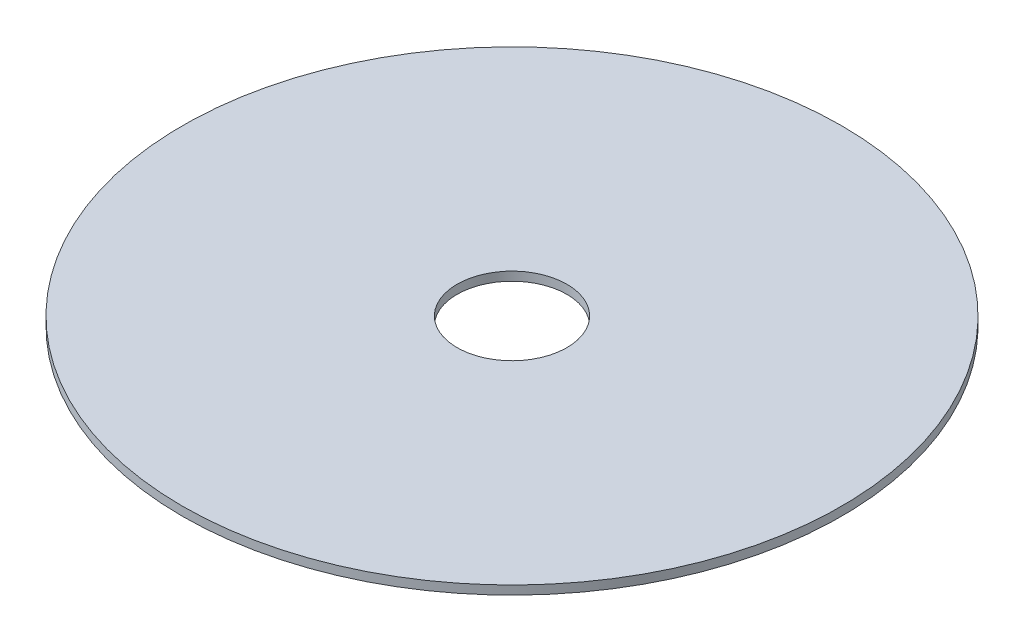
ISO-10303-21;
HEADER;
FILE_DESCRIPTION(('STEP AP214'),'2;1');
FILE_NAME('part.step','',(''),(''),'','','');
FILE_SCHEMA(('AUTOMOTIVE_DESIGN { 1 0 10303 214 1 1 1 1 }'));
ENDSEC;
DATA;
#1=APPLICATION_CONTEXT('core data for automotive mechanical design processes');
#2=APPLICATION_PROTOCOL_DEFINITION('international standard','automotive_design',2000,#1);
#3=PRODUCT_CONTEXT('',#1,'mechanical');
#4=PRODUCT('Part','Part','',(#3));
#5=PRODUCT_RELATED_PRODUCT_CATEGORY('part','',(#4));
#6=PRODUCT_DEFINITION_FORMATION('','',#4);
#7=PRODUCT_DEFINITION_CONTEXT('part definition',#1,'design');
#8=PRODUCT_DEFINITION('design','',#6,#7);
#9=PRODUCT_DEFINITION_SHAPE('','',#8);
#10=(LENGTH_UNIT() NAMED_UNIT(*) SI_UNIT(.MILLI.,.METRE.));
#11=(NAMED_UNIT(*) PLANE_ANGLE_UNIT() SI_UNIT($,.RADIAN.));
#12=(NAMED_UNIT(*) SI_UNIT($,.STERADIAN.) SOLID_ANGLE_UNIT());
#13=UNCERTAINTY_MEASURE_WITH_UNIT(LENGTH_MEASURE(1.E-05),#10,'distance_accuracy_value','');
#14=(GEOMETRIC_REPRESENTATION_CONTEXT(3) GLOBAL_UNCERTAINTY_ASSIGNED_CONTEXT((#13)) GLOBAL_UNIT_ASSIGNED_CONTEXT((#10,
#11,#12)) REPRESENTATION_CONTEXT('',''));
#15=CARTESIAN_POINT('',(0.,0.,0.));
#16=DIRECTION('',(0.,0.,1.));
#17=DIRECTION('',(1.,0.,0.));
#18=AXIS2_PLACEMENT_3D('',#15,#16,#17);
#19=CARTESIAN_POINT('',(0.,0.762,0.));
#20=DIRECTION('',(0.,1.,0.));
#21=DIRECTION('',(0.,0.,1.));
#22=AXIS2_PLACEMENT_3D('',#19,#20,#21);
#23=PLANE('',#22);
#24=CARTESIAN_POINT('',(0.,0.762,0.));
#25=DIRECTION('',(0.,1.,0.));
#26=DIRECTION('',(0.,0.,1.));
#27=AXIS2_PLACEMENT_3D('',#24,#25,#26);
#28=CIRCLE('',#27,28.575);
#29=CARTESIAN_POINT('',(0.,0.762,-28.575));
#30=VERTEX_POINT('',#29);
#31=EDGE_CURVE('E10',#30,#30,#28,.T.);
#32=ORIENTED_EDGE('',*,*,#31,.T.);
#33=EDGE_LOOP('',(#32));
#34=FACE_BOUND('',#33,.T.);
#35=CARTESIAN_POINT('',(0.,0.762,0.));
#36=DIRECTION('',(0.,1.,0.));
#37=DIRECTION('',(0.,0.,1.));
#38=AXIS2_PLACEMENT_3D('',#35,#36,#37);
#39=CIRCLE('',#38,4.7625);
#40=CARTESIAN_POINT('',(0.,0.762,-4.7625));
#41=VERTEX_POINT('',#40);
#42=EDGE_CURVE('E43',#41,#41,#39,.T.);
#43=ORIENTED_EDGE('',*,*,#42,.F.);
#44=EDGE_LOOP('',(#43));
#45=FACE_BOUND('',#44,.T.);
#46=ADVANCED_FACE('F32',(#34,#45),#23,.T.);
#47=CARTESIAN_POINT('',(0.,0.,0.));
#48=DIRECTION('',(0.,1.,0.));
#49=DIRECTION('',(0.,0.,1.));
#50=AXIS2_PLACEMENT_3D('',#47,#48,#49);
#51=PLANE('',#50);
#52=CARTESIAN_POINT('',(0.,0.,0.));
#53=DIRECTION('',(0.,1.,0.));
#54=DIRECTION('',(0.,0.,1.));
#55=AXIS2_PLACEMENT_3D('',#52,#53,#54);
#56=CIRCLE('',#55,28.575);
#57=CARTESIAN_POINT('',(0.,0.,-28.575));
#58=VERTEX_POINT('',#57);
#59=EDGE_CURVE('E36',#58,#58,#56,.T.);
#60=ORIENTED_EDGE('',*,*,#59,.F.);
#61=EDGE_LOOP('',(#60));
#62=FACE_BOUND('',#61,.T.);
#63=CARTESIAN_POINT('',(0.,0.,0.));
#64=DIRECTION('',(0.,1.,0.));
#65=DIRECTION('',(0.,0.,1.));
#66=AXIS2_PLACEMENT_3D('',#63,#64,#65);
#67=CIRCLE('',#66,4.7625);
#68=CARTESIAN_POINT('',(0.,0.,-4.7625));
#69=VERTEX_POINT('',#68);
#70=EDGE_CURVE('E45',#69,#69,#67,.T.);
#71=ORIENTED_EDGE('',*,*,#70,.T.);
#72=EDGE_LOOP('',(#71));
#73=FACE_BOUND('',#72,.T.);
#74=ADVANCED_FACE('F55',(#62,#73),#51,.F.);
#75=CARTESIAN_POINT('',(0.,0.762,0.));
#76=DIRECTION('',(0.,-1.,0.));
#77=DIRECTION('',(0.,0.,-1.));
#78=AXIS2_PLACEMENT_3D('',#75,#76,#77);
#79=CYLINDRICAL_SURFACE('',#78,28.575);
#80=CARTESIAN_POINT('',(0.,0.762,-28.575));
#81=CARTESIAN_POINT('',(0.,0.7540625,-28.575));
#82=CARTESIAN_POINT('',(0.,0.746125,-28.575));
#83=CARTESIAN_POINT('',(0.,0.73025,-28.575));
#84=CARTESIAN_POINT('',(0.,0.7223125,-28.575));
#85=CARTESIAN_POINT('',(0.,0.7064375,-28.575));
#86=CARTESIAN_POINT('',(0.,0.6985,-28.575));
#87=CARTESIAN_POINT('',(0.,0.682625,-28.575));
#88=CARTESIAN_POINT('',(0.,0.6746875,-28.575));
#89=CARTESIAN_POINT('',(0.,0.6588125,-28.575));
#90=CARTESIAN_POINT('',(0.,0.650875,-28.575));
#91=CARTESIAN_POINT('',(0.,0.635,-28.575));
#92=CARTESIAN_POINT('',(0.,0.6270625,-28.575));
#93=CARTESIAN_POINT('',(0.,0.6111875,-28.575));
#94=CARTESIAN_POINT('',(0.,0.60325,-28.575));
#95=CARTESIAN_POINT('',(0.,0.587375,-28.575));
#96=CARTESIAN_POINT('',(0.,0.5794375,-28.575));
#97=CARTESIAN_POINT('',(0.,0.5635625,-28.575));
#98=CARTESIAN_POINT('',(0.,0.555625,-28.575));
#99=CARTESIAN_POINT('',(0.,0.53975,-28.575));
#100=CARTESIAN_POINT('',(0.,0.5318125,-28.575));
#101=CARTESIAN_POINT('',(0.,0.5159375,-28.575));
#102=CARTESIAN_POINT('',(0.,0.508,-28.575));
#103=CARTESIAN_POINT('',(0.,0.492125,-28.575));
#104=CARTESIAN_POINT('',(0.,0.4841875,-28.575));
#105=CARTESIAN_POINT('',(0.,0.4683125,-28.575));
#106=CARTESIAN_POINT('',(0.,0.460375,-28.575));
#107=CARTESIAN_POINT('',(0.,0.4445,-28.575));
#108=CARTESIAN_POINT('',(0.,0.4365625,-28.575));
#109=CARTESIAN_POINT('',(0.,0.4206875,-28.575));
#110=CARTESIAN_POINT('',(0.,0.41275,-28.575));
#111=CARTESIAN_POINT('',(0.,0.396875,-28.575));
#112=CARTESIAN_POINT('',(0.,0.3889375,-28.575));
#113=CARTESIAN_POINT('',(0.,0.3730625,-28.575));
#114=CARTESIAN_POINT('',(0.,0.365125,-28.575));
#115=CARTESIAN_POINT('',(0.,0.34925,-28.575));
#116=CARTESIAN_POINT('',(0.,0.3413125,-28.575));
#117=CARTESIAN_POINT('',(0.,0.3254375,-28.575));
#118=CARTESIAN_POINT('',(0.,0.3175,-28.575));
#119=CARTESIAN_POINT('',(0.,0.301625,-28.575));
#120=CARTESIAN_POINT('',(0.,0.2936875,-28.575));
#121=CARTESIAN_POINT('',(0.,0.2778125,-28.575));
#122=CARTESIAN_POINT('',(0.,0.269875,-28.575));
#123=CARTESIAN_POINT('',(0.,0.254,-28.575));
#124=CARTESIAN_POINT('',(0.,0.2460625,-28.575));
#125=CARTESIAN_POINT('',(0.,0.2301875,-28.575));
#126=CARTESIAN_POINT('',(0.,0.22225,-28.575));
#127=CARTESIAN_POINT('',(0.,0.206375,-28.575));
#128=CARTESIAN_POINT('',(0.,0.1984375,-28.575));
#129=CARTESIAN_POINT('',(0.,0.1825625,-28.575));
#130=CARTESIAN_POINT('',(0.,0.174625,-28.575));
#131=CARTESIAN_POINT('',(0.,0.15875,-28.575));
#132=CARTESIAN_POINT('',(0.,0.1508125,-28.575));
#133=CARTESIAN_POINT('',(0.,0.1349375,-28.575));
#134=CARTESIAN_POINT('',(0.,0.127,-28.575));
#135=CARTESIAN_POINT('',(0.,0.111125,-28.575));
#136=CARTESIAN_POINT('',(0.,0.1031875,-28.575));
#137=CARTESIAN_POINT('',(0.,0.0873125,-28.575));
#138=CARTESIAN_POINT('',(0.,0.079375,-28.575));
#139=CARTESIAN_POINT('',(0.,0.0635,-28.575));
#140=CARTESIAN_POINT('',(0.,0.0555625,-28.575));
#141=CARTESIAN_POINT('',(0.,0.0396875,-28.575));
#142=CARTESIAN_POINT('',(0.,0.03175,-28.575));
#143=CARTESIAN_POINT('',(0.,0.015875,-28.575));
#144=CARTESIAN_POINT('',(0.,0.00793749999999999,-28.575));
#145=CARTESIAN_POINT('',(0.,0.,-28.575));
#146=B_SPLINE_CURVE_WITH_KNOTS('',3,(#80,#81,#82,#83,#84,#85,#86,#87,#88,#89,#90,#91,#92,#93,
#94,#95,#96,#97,#98,#99,#100,#101,#102,#103,#104,#105,#106,#107,#108,#109,#110,#111,#112,#113,
#114,#115,#116,#117,#118,#119,#120,#121,#122,#123,#124,#125,#126,#127,#128,#129,#130,#131,#132,
#133,#134,#135,#136,#137,#138,#139,#140,#141,#142,#143,#144,#145),.UNSPECIFIED.,.F.,.F.,(4,2,2,
2,2,2,2,2,2,2,2,2,2,2,2,2,2,2,2,2,2,2,2,2,2,2,2,2,2,2,2,2,4),(0.,0.0238125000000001,0.047625,
0.0714375,0.0952500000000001,0.1190625,0.142875,0.1666875,0.1905,0.2143125,0.238125,0.2619375,
0.28575,0.3095625,0.333375,0.3571875,0.381,0.4048125,0.428625,0.4524375,0.47625,0.5000625,
0.523875,0.5476875,0.5715,0.5953125,0.619125,0.6429375,0.66675,0.6905625,0.714375,0.7381875,
0.762),.UNSPECIFIED.);
#147=EDGE_CURVE('BSEAM34',#30,#58,#146,.T.);
#148=ORIENTED_EDGE('',*,*,#31,.F.);
#149=ORIENTED_EDGE('',*,*,#59,.T.);
#150=ORIENTED_EDGE('',*,*,#147,.T.);
#151=ORIENTED_EDGE('',*,*,#147,.F.);
#152=EDGE_LOOP('',(#148,#150,#149,#151));
#153=FACE_BOUND('',#152,.T.);
#154=ADVANCED_FACE('F34',(#153),#79,.T.);
#155=CARTESIAN_POINT('',(0.,0.762,0.));
#156=DIRECTION('',(0.,-1.,0.));
#157=DIRECTION('',(0.,0.,-1.));
#158=AXIS2_PLACEMENT_3D('',#155,#156,#157);
#159=CYLINDRICAL_SURFACE('',#158,4.7625);
#160=CARTESIAN_POINT('',(0.,0.762,-4.7625));
#161=CARTESIAN_POINT('',(0.,0.7540625,-4.7625));
#162=CARTESIAN_POINT('',(0.,0.746125,-4.7625));
#163=CARTESIAN_POINT('',(0.,0.73025,-4.7625));
#164=CARTESIAN_POINT('',(0.,0.7223125,-4.7625));
#165=CARTESIAN_POINT('',(0.,0.7064375,-4.7625));
#166=CARTESIAN_POINT('',(0.,0.6985,-4.7625));
#167=CARTESIAN_POINT('',(0.,0.682625,-4.7625));
#168=CARTESIAN_POINT('',(0.,0.6746875,-4.7625));
#169=CARTESIAN_POINT('',(0.,0.6588125,-4.7625));
#170=CARTESIAN_POINT('',(0.,0.650875,-4.7625));
#171=CARTESIAN_POINT('',(0.,0.635,-4.7625));
#172=CARTESIAN_POINT('',(0.,0.6270625,-4.7625));
#173=CARTESIAN_POINT('',(0.,0.6111875,-4.7625));
#174=CARTESIAN_POINT('',(0.,0.60325,-4.7625));
#175=CARTESIAN_POINT('',(0.,0.587375,-4.7625));
#176=CARTESIAN_POINT('',(0.,0.5794375,-4.7625));
#177=CARTESIAN_POINT('',(0.,0.5635625,-4.7625));
#178=CARTESIAN_POINT('',(0.,0.555625,-4.7625));
#179=CARTESIAN_POINT('',(0.,0.53975,-4.7625));
#180=CARTESIAN_POINT('',(0.,0.5318125,-4.7625));
#181=CARTESIAN_POINT('',(0.,0.5159375,-4.7625));
#182=CARTESIAN_POINT('',(0.,0.508,-4.7625));
#183=CARTESIAN_POINT('',(0.,0.492125,-4.7625));
#184=CARTESIAN_POINT('',(0.,0.4841875,-4.7625));
#185=CARTESIAN_POINT('',(0.,0.4683125,-4.7625));
#186=CARTESIAN_POINT('',(0.,0.460375,-4.7625));
#187=CARTESIAN_POINT('',(0.,0.4445,-4.7625));
#188=CARTESIAN_POINT('',(0.,0.4365625,-4.7625));
#189=CARTESIAN_POINT('',(0.,0.4206875,-4.7625));
#190=CARTESIAN_POINT('',(0.,0.41275,-4.7625));
#191=CARTESIAN_POINT('',(0.,0.396875,-4.7625));
#192=CARTESIAN_POINT('',(0.,0.3889375,-4.7625));
#193=CARTESIAN_POINT('',(0.,0.3730625,-4.7625));
#194=CARTESIAN_POINT('',(0.,0.365125,-4.7625));
#195=CARTESIAN_POINT('',(0.,0.34925,-4.7625));
#196=CARTESIAN_POINT('',(0.,0.3413125,-4.7625));
#197=CARTESIAN_POINT('',(0.,0.3254375,-4.7625));
#198=CARTESIAN_POINT('',(0.,0.3175,-4.7625));
#199=CARTESIAN_POINT('',(0.,0.301625,-4.7625));
#200=CARTESIAN_POINT('',(0.,0.2936875,-4.7625));
#201=CARTESIAN_POINT('',(0.,0.2778125,-4.7625));
#202=CARTESIAN_POINT('',(0.,0.269875,-4.7625));
#203=CARTESIAN_POINT('',(0.,0.254,-4.7625));
#204=CARTESIAN_POINT('',(0.,0.2460625,-4.7625));
#205=CARTESIAN_POINT('',(0.,0.2301875,-4.7625));
#206=CARTESIAN_POINT('',(0.,0.22225,-4.7625));
#207=CARTESIAN_POINT('',(0.,0.206375,-4.7625));
#208=CARTESIAN_POINT('',(0.,0.1984375,-4.7625));
#209=CARTESIAN_POINT('',(0.,0.1825625,-4.7625));
#210=CARTESIAN_POINT('',(0.,0.174625,-4.7625));
#211=CARTESIAN_POINT('',(0.,0.15875,-4.7625));
#212=CARTESIAN_POINT('',(0.,0.1508125,-4.7625));
#213=CARTESIAN_POINT('',(0.,0.1349375,-4.7625));
#214=CARTESIAN_POINT('',(0.,0.127,-4.7625));
#215=CARTESIAN_POINT('',(0.,0.111125,-4.7625));
#216=CARTESIAN_POINT('',(0.,0.1031875,-4.7625));
#217=CARTESIAN_POINT('',(0.,0.0873125,-4.7625));
#218=CARTESIAN_POINT('',(0.,0.079375,-4.7625));
#219=CARTESIAN_POINT('',(0.,0.0635,-4.7625));
#220=CARTESIAN_POINT('',(0.,0.0555625,-4.7625));
#221=CARTESIAN_POINT('',(0.,0.0396875,-4.7625));
#222=CARTESIAN_POINT('',(0.,0.03175,-4.7625));
#223=CARTESIAN_POINT('',(0.,0.015875,-4.7625));
#224=CARTESIAN_POINT('',(0.,0.00793749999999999,-4.7625));
#225=CARTESIAN_POINT('',(0.,0.,-4.7625));
#226=B_SPLINE_CURVE_WITH_KNOTS('',3,(#160,#161,#162,#163,#164,#165,#166,#167,#168,#169,#170,
#171,#172,#173,#174,#175,#176,#177,#178,#179,#180,#181,#182,#183,#184,#185,#186,#187,#188,#189,
#190,#191,#192,#193,#194,#195,#196,#197,#198,#199,#200,#201,#202,#203,#204,#205,#206,#207,#208,
#209,#210,#211,#212,#213,#214,#215,#216,#217,#218,#219,#220,#221,#222,#223,#224,#225),
.UNSPECIFIED.,.F.,.F.,(4,2,2,2,2,2,2,2,2,2,2,2,2,2,2,2,2,2,2,2,2,2,2,2,2,2,2,2,2,2,2,2,4),(0.,
0.0238125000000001,0.047625,0.0714375,0.0952500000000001,0.1190625,0.142875,0.1666875,0.1905,
0.2143125,0.238125,0.2619375,0.28575,0.3095625,0.333375,0.3571875,0.381,0.4048125,0.428625,
0.4524375,0.47625,0.5000625,0.523875,0.5476875,0.5715,0.5953125,0.619125,0.6429375,0.66675,
0.6905625,0.714375,0.7381875,0.762),.UNSPECIFIED.);
#227=EDGE_CURVE('BSEAM51',#41,#69,#226,.T.);
#228=ORIENTED_EDGE('',*,*,#42,.T.);
#229=ORIENTED_EDGE('',*,*,#70,.F.);
#230=ORIENTED_EDGE('',*,*,#227,.T.);
#231=ORIENTED_EDGE('',*,*,#227,.F.);
#232=EDGE_LOOP('',(#228,#230,#229,#231));
#233=FACE_BOUND('',#232,.T.);
#234=ADVANCED_FACE('F51',(#233),#159,.F.);
#235=CLOSED_SHELL('',(#46,#74,#154,#234));
#236=MANIFOLD_SOLID_BREP('B2',#235);
#237=ADVANCED_BREP_SHAPE_REPRESENTATION('',(#18,#236),#14);
#238=SHAPE_DEFINITION_REPRESENTATION(#9,#237);
ENDSEC;
END-ISO-10303-21;
